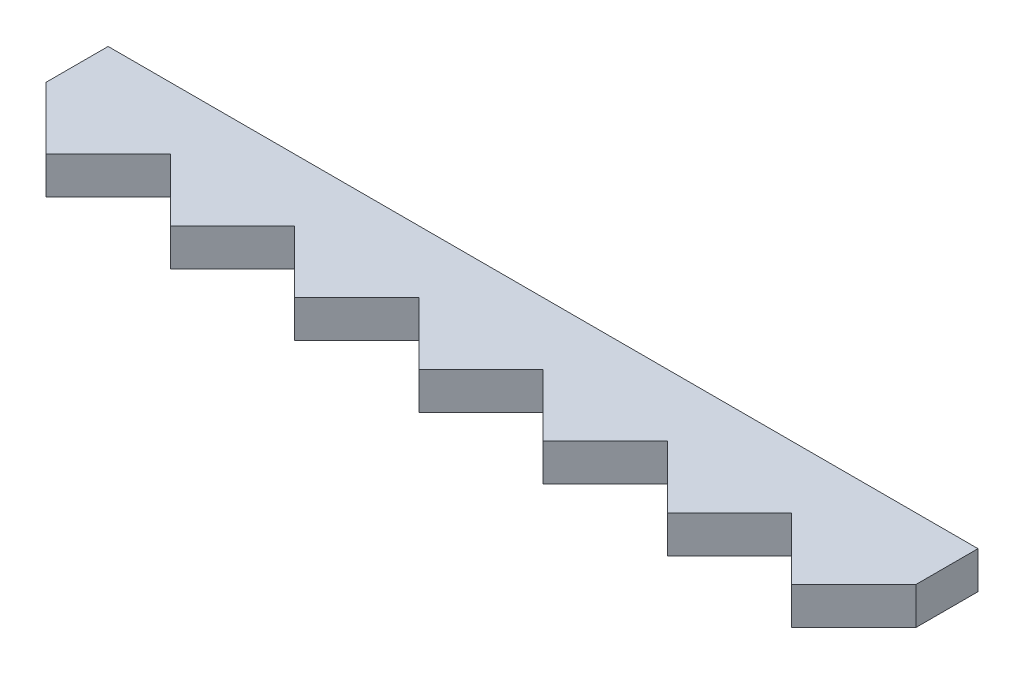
ISO-10303-21;
HEADER;
FILE_DESCRIPTION(('STEP AP214'),'2;1');
FILE_NAME('part.step','',(''),(''),'','','');
FILE_SCHEMA(('AUTOMOTIVE_DESIGN { 1 0 10303 214 1 1 1 1 }'));
ENDSEC;
DATA;
#1=APPLICATION_CONTEXT('core data for automotive mechanical design processes');
#2=APPLICATION_PROTOCOL_DEFINITION('international standard','automotive_design',2000,#1);
#3=PRODUCT_CONTEXT('',#1,'mechanical');
#4=PRODUCT('Part','Part','',(#3));
#5=PRODUCT_RELATED_PRODUCT_CATEGORY('part','',(#4));
#6=PRODUCT_DEFINITION_FORMATION('','',#4);
#7=PRODUCT_DEFINITION_CONTEXT('part definition',#1,'design');
#8=PRODUCT_DEFINITION('design','',#6,#7);
#9=PRODUCT_DEFINITION_SHAPE('','',#8);
#10=(LENGTH_UNIT() NAMED_UNIT(*) SI_UNIT(.MILLI.,.METRE.));
#11=(NAMED_UNIT(*) PLANE_ANGLE_UNIT() SI_UNIT($,.RADIAN.));
#12=(NAMED_UNIT(*) SI_UNIT($,.STERADIAN.) SOLID_ANGLE_UNIT());
#13=UNCERTAINTY_MEASURE_WITH_UNIT(LENGTH_MEASURE(1.E-05),#10,'distance_accuracy_value','');
#14=(GEOMETRIC_REPRESENTATION_CONTEXT(3) GLOBAL_UNCERTAINTY_ASSIGNED_CONTEXT((#13)) GLOBAL_UNIT_ASSIGNED_CONTEXT((#10,
#11,#12)) REPRESENTATION_CONTEXT('',''));
#15=CARTESIAN_POINT('',(0.,0.,0.));
#16=DIRECTION('',(0.,0.,1.));
#17=DIRECTION('',(1.,0.,0.));
#18=AXIS2_PLACEMENT_3D('',#15,#16,#17);
#19=CARTESIAN_POINT('',(0.,6.,-32.1404036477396));
#20=DIRECTION('',(0.,0.,1.));
#21=DIRECTION('',(1.,0.,0.));
#22=AXIS2_PLACEMENT_3D('',#19,#20,#21);
#23=PLANE('',#22);
#24=DIRECTION('',(-1.,0.,0.));
#25=VECTOR('',#24,1.);
#26=CARTESIAN_POINT('',(0.,3.,-32.1404036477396));
#27=LINE('',#26,#25);
#28=CARTESIAN_POINT('',(70.,3.,-32.1404036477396));
#29=VERTEX_POINT('',#28);
#30=CARTESIAN_POINT('',(0.,3.,-32.1404036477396));
#31=VERTEX_POINT('',#30);
#32=EDGE_CURVE('E183',#29,#31,#27,.T.);
#33=ORIENTED_EDGE('',*,*,#32,.T.);
#34=DIRECTION('',(0.,-1.,0.));
#35=VECTOR('',#34,1.);
#36=CARTESIAN_POINT('',(0.,6.,-32.1404036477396));
#37=LINE('',#36,#35);
#38=CARTESIAN_POINT('',(0.,6.,-32.1404036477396));
#39=VERTEX_POINT('',#38);
#40=EDGE_CURVE('E11',#39,#31,#37,.T.);
#41=ORIENTED_EDGE('',*,*,#40,.F.);
#42=DIRECTION('',(-1.,0.,0.));
#43=VECTOR('',#42,1.);
#44=CARTESIAN_POINT('',(0.,6.,-32.1404036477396));
#45=LINE('',#44,#43);
#46=CARTESIAN_POINT('',(70.,6.,-32.1404036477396));
#47=VERTEX_POINT('',#46);
#48=EDGE_CURVE('E215',#47,#39,#45,.T.);
#49=ORIENTED_EDGE('',*,*,#48,.F.);
#50=DIRECTION('',(0.,-1.,0.));
#51=VECTOR('',#50,1.);
#52=CARTESIAN_POINT('',(70.,6.,-32.1404036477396));
#53=LINE('',#52,#51);
#54=EDGE_CURVE('E179',#47,#29,#53,.T.);
#55=ORIENTED_EDGE('',*,*,#54,.T.);
#56=EDGE_LOOP('',(#33,#41,#49,#55));
#57=FACE_BOUND('',#56,.T.);
#58=ADVANCED_FACE('F33',(#57),#23,.F.);
#59=CARTESIAN_POINT('',(0.,6.,-32.1404036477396));
#60=DIRECTION('',(1.,0.,0.));
#61=DIRECTION('',(0.,0.,-1.));
#62=AXIS2_PLACEMENT_3D('',#59,#60,#61);
#63=PLANE('',#62);
#64=DIRECTION('',(0.,0.,1.));
#65=VECTOR('',#64,1.);
#66=CARTESIAN_POINT('',(0.,3.,-32.1404036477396));
#67=LINE('',#66,#65);
#68=CARTESIAN_POINT('',(0.,3.,-27.1404036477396));
#69=VERTEX_POINT('',#68);
#70=EDGE_CURVE('E186',#31,#69,#67,.T.);
#71=ORIENTED_EDGE('',*,*,#70,.T.);
#72=DIRECTION('',(0.,-1.,0.));
#73=VECTOR('',#72,1.);
#74=CARTESIAN_POINT('',(0.,6.,-27.1404036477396));
#75=LINE('',#74,#73);
#76=CARTESIAN_POINT('',(0.,6.,-27.1404036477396));
#77=VERTEX_POINT('',#76);
#78=EDGE_CURVE('E41',#77,#69,#75,.T.);
#79=ORIENTED_EDGE('',*,*,#78,.F.);
#80=DIRECTION('',(0.,0.,1.));
#81=VECTOR('',#80,1.);
#82=CARTESIAN_POINT('',(0.,6.,-32.1404036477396));
#83=LINE('',#82,#81);
#84=EDGE_CURVE('E119',#39,#77,#83,.T.);
#85=ORIENTED_EDGE('',*,*,#84,.F.);
#86=ORIENTED_EDGE('',*,*,#40,.T.);
#87=EDGE_LOOP('',(#71,#79,#85,#86));
#88=FACE_BOUND('',#87,.T.);
#89=ADVANCED_FACE('F318',(#88),#63,.F.);
#90=CARTESIAN_POINT('',(0.,6.,-27.1404036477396));
#91=DIRECTION('',(0.707106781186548,0.,-0.707106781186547));
#92=DIRECTION('',(-0.707106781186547,0.,-0.707106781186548));
#93=AXIS2_PLACEMENT_3D('',#90,#91,#92);
#94=PLANE('',#93);
#95=DIRECTION('',(0.707106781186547,0.,0.707106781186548));
#96=VECTOR('',#95,1.);
#97=CARTESIAN_POINT('',(0.,3.,-27.1404036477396));
#98=LINE('',#97,#96);
#99=CARTESIAN_POINT('',(5.,3.,-22.1404036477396));
#100=VERTEX_POINT('',#99);
#101=EDGE_CURVE('E188',#69,#100,#98,.T.);
#102=ORIENTED_EDGE('',*,*,#101,.T.);
#103=DIRECTION('',(0.,-1.,0.));
#104=VECTOR('',#103,1.);
#105=CARTESIAN_POINT('',(5.,6.,-22.1404036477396));
#106=LINE('',#105,#104);
#107=CARTESIAN_POINT('',(5.,6.,-22.1404036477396));
#108=VERTEX_POINT('',#107);
#109=EDGE_CURVE('E249',#108,#100,#106,.T.);
#110=ORIENTED_EDGE('',*,*,#109,.F.);
#111=DIRECTION('',(0.707106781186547,0.,0.707106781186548));
#112=VECTOR('',#111,1.);
#113=CARTESIAN_POINT('',(0.,6.,-27.1404036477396));
#114=LINE('',#113,#112);
#115=EDGE_CURVE('E257',#77,#108,#114,.T.);
#116=ORIENTED_EDGE('',*,*,#115,.F.);
#117=ORIENTED_EDGE('',*,*,#78,.T.);
#118=EDGE_LOOP('',(#102,#110,#116,#117));
#119=FACE_BOUND('',#118,.T.);
#120=ADVANCED_FACE('F255',(#119),#94,.F.);
#121=CARTESIAN_POINT('',(5.,6.,-22.1404036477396));
#122=DIRECTION('',(-0.707106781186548,0.,-0.707106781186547));
#123=DIRECTION('',(-0.707106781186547,0.,0.707106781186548));
#124=AXIS2_PLACEMENT_3D('',#121,#122,#123);
#125=PLANE('',#124);
#126=DIRECTION('',(0.707106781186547,0.,-0.707106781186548));
#127=VECTOR('',#126,1.);
#128=CARTESIAN_POINT('',(5.,3.,-22.1404036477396));
#129=LINE('',#128,#127);
#130=CARTESIAN_POINT('',(10.,3.,-27.1404036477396));
#131=VERTEX_POINT('',#130);
#132=EDGE_CURVE('E190',#100,#131,#129,.T.);
#133=ORIENTED_EDGE('',*,*,#132,.T.);
#134=DIRECTION('',(0.,-1.,0.));
#135=VECTOR('',#134,1.);
#136=CARTESIAN_POINT('',(10.,6.,-27.1404036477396));
#137=LINE('',#136,#135);
#138=CARTESIAN_POINT('',(10.,6.,-27.1404036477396));
#139=VERTEX_POINT('',#138);
#140=EDGE_CURVE('E246',#139,#131,#137,.T.);
#141=ORIENTED_EDGE('',*,*,#140,.F.);
#142=DIRECTION('',(0.707106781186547,0.,-0.707106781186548));
#143=VECTOR('',#142,1.);
#144=CARTESIAN_POINT('',(5.,6.,-22.1404036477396));
#145=LINE('',#144,#143);
#146=EDGE_CURVE('E275',#108,#139,#145,.T.);
#147=ORIENTED_EDGE('',*,*,#146,.F.);
#148=ORIENTED_EDGE('',*,*,#109,.T.);
#149=EDGE_LOOP('',(#133,#141,#147,#148));
#150=FACE_BOUND('',#149,.T.);
#151=ADVANCED_FACE('F266',(#150),#125,.F.);
#152=CARTESIAN_POINT('',(10.,6.,-27.1404036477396));
#153=DIRECTION('',(0.707106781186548,0.,-0.707106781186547));
#154=DIRECTION('',(-0.707106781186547,0.,-0.707106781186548));
#155=AXIS2_PLACEMENT_3D('',#152,#153,#154);
#156=PLANE('',#155);
#157=DIRECTION('',(0.707106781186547,0.,0.707106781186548));
#158=VECTOR('',#157,1.);
#159=CARTESIAN_POINT('',(10.,3.,-27.1404036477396));
#160=LINE('',#159,#158);
#161=CARTESIAN_POINT('',(15.,3.,-22.1404036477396));
#162=VERTEX_POINT('',#161);
#163=EDGE_CURVE('E192',#131,#162,#160,.T.);
#164=ORIENTED_EDGE('',*,*,#163,.T.);
#165=DIRECTION('',(0.,-1.,0.));
#166=VECTOR('',#165,1.);
#167=CARTESIAN_POINT('',(15.,6.,-22.1404036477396));
#168=LINE('',#167,#166);
#169=CARTESIAN_POINT('',(15.,6.,-22.1404036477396));
#170=VERTEX_POINT('',#169);
#171=EDGE_CURVE('E243',#170,#162,#168,.T.);
#172=ORIENTED_EDGE('',*,*,#171,.F.);
#173=DIRECTION('',(0.707106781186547,0.,0.707106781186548));
#174=VECTOR('',#173,1.);
#175=CARTESIAN_POINT('',(10.,6.,-27.1404036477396));
#176=LINE('',#175,#174);
#177=EDGE_CURVE('E272',#139,#170,#176,.T.);
#178=ORIENTED_EDGE('',*,*,#177,.F.);
#179=ORIENTED_EDGE('',*,*,#140,.T.);
#180=EDGE_LOOP('',(#164,#172,#178,#179));
#181=FACE_BOUND('',#180,.T.);
#182=ADVANCED_FACE('F270',(#181),#156,.F.);
#183=CARTESIAN_POINT('',(15.,6.,-22.1404036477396));
#184=DIRECTION('',(-0.707106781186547,0.,-0.707106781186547));
#185=DIRECTION('',(-0.707106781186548,0.,0.707106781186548));
#186=AXIS2_PLACEMENT_3D('',#183,#184,#185);
#187=PLANE('',#186);
#188=DIRECTION('',(0.707106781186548,0.,-0.707106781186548));
#189=VECTOR('',#188,1.);
#190=CARTESIAN_POINT('',(15.,3.,-22.1404036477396));
#191=LINE('',#190,#189);
#192=CARTESIAN_POINT('',(20.,3.,-27.1404036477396));
#193=VERTEX_POINT('',#192);
#194=EDGE_CURVE('E194',#162,#193,#191,.T.);
#195=ORIENTED_EDGE('',*,*,#194,.T.);
#196=DIRECTION('',(0.,-1.,0.));
#197=VECTOR('',#196,1.);
#198=CARTESIAN_POINT('',(20.,6.,-27.1404036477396));
#199=LINE('',#198,#197);
#200=CARTESIAN_POINT('',(20.,6.,-27.1404036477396));
#201=VERTEX_POINT('',#200);
#202=EDGE_CURVE('E240',#201,#193,#199,.T.);
#203=ORIENTED_EDGE('',*,*,#202,.F.);
#204=DIRECTION('',(0.707106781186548,0.,-0.707106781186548));
#205=VECTOR('',#204,1.);
#206=CARTESIAN_POINT('',(15.,6.,-22.1404036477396));
#207=LINE('',#206,#205);
#208=EDGE_CURVE('E274',#170,#201,#207,.T.);
#209=ORIENTED_EDGE('',*,*,#208,.F.);
#210=ORIENTED_EDGE('',*,*,#171,.T.);
#211=EDGE_LOOP('',(#195,#203,#209,#210));
#212=FACE_BOUND('',#211,.T.);
#213=ADVANCED_FACE('F331',(#212),#187,.F.);
#214=CARTESIAN_POINT('',(20.,6.,-27.1404036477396));
#215=DIRECTION('',(0.707106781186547,0.,-0.707106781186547));
#216=DIRECTION('',(-0.707106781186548,0.,-0.707106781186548));
#217=AXIS2_PLACEMENT_3D('',#214,#215,#216);
#218=PLANE('',#217);
#219=DIRECTION('',(0.707106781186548,0.,0.707106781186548));
#220=VECTOR('',#219,1.);
#221=CARTESIAN_POINT('',(20.,3.,-27.1404036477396));
#222=LINE('',#221,#220);
#223=CARTESIAN_POINT('',(25.,3.,-22.1404036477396));
#224=VERTEX_POINT('',#223);
#225=EDGE_CURVE('E196',#193,#224,#222,.T.);
#226=ORIENTED_EDGE('',*,*,#225,.T.);
#227=DIRECTION('',(0.,-1.,0.));
#228=VECTOR('',#227,1.);
#229=CARTESIAN_POINT('',(25.,6.,-22.1404036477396));
#230=LINE('',#229,#228);
#231=CARTESIAN_POINT('',(25.,6.,-22.1404036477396));
#232=VERTEX_POINT('',#231);
#233=EDGE_CURVE('E237',#232,#224,#230,.T.);
#234=ORIENTED_EDGE('',*,*,#233,.F.);
#235=DIRECTION('',(0.707106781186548,0.,0.707106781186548));
#236=VECTOR('',#235,1.);
#237=CARTESIAN_POINT('',(20.,6.,-27.1404036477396));
#238=LINE('',#237,#236);
#239=EDGE_CURVE('E277',#201,#232,#238,.T.);
#240=ORIENTED_EDGE('',*,*,#239,.F.);
#241=ORIENTED_EDGE('',*,*,#202,.T.);
#242=EDGE_LOOP('',(#226,#234,#240,#241));
#243=FACE_BOUND('',#242,.T.);
#244=ADVANCED_FACE('F334',(#243),#218,.F.);
#245=CARTESIAN_POINT('',(25.,6.,-22.1404036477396));
#246=DIRECTION('',(-0.707106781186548,0.,-0.707106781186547));
#247=DIRECTION('',(-0.707106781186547,0.,0.707106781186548));
#248=AXIS2_PLACEMENT_3D('',#245,#246,#247);
#249=PLANE('',#248);
#250=DIRECTION('',(0.707106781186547,0.,-0.707106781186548));
#251=VECTOR('',#250,1.);
#252=CARTESIAN_POINT('',(25.,3.,-22.1404036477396));
#253=LINE('',#252,#251);
#254=CARTESIAN_POINT('',(30.,3.,-27.1404036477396));
#255=VERTEX_POINT('',#254);
#256=EDGE_CURVE('E198',#224,#255,#253,.T.);
#257=ORIENTED_EDGE('',*,*,#256,.T.);
#258=DIRECTION('',(0.,-1.,0.));
#259=VECTOR('',#258,1.);
#260=CARTESIAN_POINT('',(30.,6.,-27.1404036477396));
#261=LINE('',#260,#259);
#262=CARTESIAN_POINT('',(30.,6.,-27.1404036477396));
#263=VERTEX_POINT('',#262);
#264=EDGE_CURVE('E234',#263,#255,#261,.T.);
#265=ORIENTED_EDGE('',*,*,#264,.F.);
#266=DIRECTION('',(0.707106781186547,0.,-0.707106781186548));
#267=VECTOR('',#266,1.);
#268=CARTESIAN_POINT('',(25.,6.,-22.1404036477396));
#269=LINE('',#268,#267);
#270=EDGE_CURVE('E283',#232,#263,#269,.T.);
#271=ORIENTED_EDGE('',*,*,#270,.F.);
#272=ORIENTED_EDGE('',*,*,#233,.T.);
#273=EDGE_LOOP('',(#257,#265,#271,#272));
#274=FACE_BOUND('',#273,.T.);
#275=ADVANCED_FACE('F338',(#274),#249,.F.);
#276=CARTESIAN_POINT('',(30.,6.,-27.1404036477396));
#277=DIRECTION('',(0.707106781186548,0.,-0.707106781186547));
#278=DIRECTION('',(-0.707106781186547,0.,-0.707106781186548));
#279=AXIS2_PLACEMENT_3D('',#276,#277,#278);
#280=PLANE('',#279);
#281=DIRECTION('',(0.707106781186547,0.,0.707106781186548));
#282=VECTOR('',#281,1.);
#283=CARTESIAN_POINT('',(30.,3.,-27.1404036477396));
#284=LINE('',#283,#282);
#285=CARTESIAN_POINT('',(35.,3.,-22.1404036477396));
#286=VERTEX_POINT('',#285);
#287=EDGE_CURVE('E200',#255,#286,#284,.T.);
#288=ORIENTED_EDGE('',*,*,#287,.T.);
#289=DIRECTION('',(0.,-1.,0.));
#290=VECTOR('',#289,1.);
#291=CARTESIAN_POINT('',(35.,6.,-22.1404036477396));
#292=LINE('',#291,#290);
#293=CARTESIAN_POINT('',(35.,6.,-22.1404036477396));
#294=VERTEX_POINT('',#293);
#295=EDGE_CURVE('E231',#294,#286,#292,.T.);
#296=ORIENTED_EDGE('',*,*,#295,.F.);
#297=DIRECTION('',(0.707106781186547,0.,0.707106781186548));
#298=VECTOR('',#297,1.);
#299=CARTESIAN_POINT('',(30.,6.,-27.1404036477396));
#300=LINE('',#299,#298);
#301=EDGE_CURVE('E285',#263,#294,#300,.T.);
#302=ORIENTED_EDGE('',*,*,#301,.F.);
#303=ORIENTED_EDGE('',*,*,#264,.T.);
#304=EDGE_LOOP('',(#288,#296,#302,#303));
#305=FACE_BOUND('',#304,.T.);
#306=ADVANCED_FACE('F342',(#305),#280,.F.);
#307=CARTESIAN_POINT('',(35.,6.,-22.1404036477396));
#308=DIRECTION('',(-0.707106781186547,0.,-0.707106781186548));
#309=DIRECTION('',(-0.707106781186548,0.,0.707106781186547));
#310=AXIS2_PLACEMENT_3D('',#307,#308,#309);
#311=PLANE('',#310);
#312=DIRECTION('',(0.707106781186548,0.,-0.707106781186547));
#313=VECTOR('',#312,1.);
#314=CARTESIAN_POINT('',(35.,3.,-22.1404036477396));
#315=LINE('',#314,#313);
#316=CARTESIAN_POINT('',(40.,3.,-27.1404036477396));
#317=VERTEX_POINT('',#316);
#318=EDGE_CURVE('E202',#286,#317,#315,.T.);
#319=ORIENTED_EDGE('',*,*,#318,.T.);
#320=DIRECTION('',(0.,-1.,0.));
#321=VECTOR('',#320,1.);
#322=CARTESIAN_POINT('',(40.,6.,-27.1404036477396));
#323=LINE('',#322,#321);
#324=CARTESIAN_POINT('',(40.,6.,-27.1404036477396));
#325=VERTEX_POINT('',#324);
#326=EDGE_CURVE('E228',#325,#317,#323,.T.);
#327=ORIENTED_EDGE('',*,*,#326,.F.);
#328=DIRECTION('',(0.707106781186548,0.,-0.707106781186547));
#329=VECTOR('',#328,1.);
#330=CARTESIAN_POINT('',(35.,6.,-22.1404036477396));
#331=LINE('',#330,#329);
#332=EDGE_CURVE('E287',#294,#325,#331,.T.);
#333=ORIENTED_EDGE('',*,*,#332,.F.);
#334=ORIENTED_EDGE('',*,*,#295,.T.);
#335=EDGE_LOOP('',(#319,#327,#333,#334));
#336=FACE_BOUND('',#335,.T.);
#337=ADVANCED_FACE('F346',(#336),#311,.F.);
#338=CARTESIAN_POINT('',(40.,6.,-27.1404036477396));
#339=DIRECTION('',(0.707106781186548,0.,-0.707106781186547));
#340=DIRECTION('',(-0.707106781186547,0.,-0.707106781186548));
#341=AXIS2_PLACEMENT_3D('',#338,#339,#340);
#342=PLANE('',#341);
#343=DIRECTION('',(0.707106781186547,0.,0.707106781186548));
#344=VECTOR('',#343,1.);
#345=CARTESIAN_POINT('',(40.,3.,-27.1404036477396));
#346=LINE('',#345,#344);
#347=CARTESIAN_POINT('',(45.,3.,-22.1404036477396));
#348=VERTEX_POINT('',#347);
#349=EDGE_CURVE('E204',#317,#348,#346,.T.);
#350=ORIENTED_EDGE('',*,*,#349,.T.);
#351=DIRECTION('',(0.,-1.,0.));
#352=VECTOR('',#351,1.);
#353=CARTESIAN_POINT('',(45.,6.,-22.1404036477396));
#354=LINE('',#353,#352);
#355=CARTESIAN_POINT('',(45.,6.,-22.1404036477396));
#356=VERTEX_POINT('',#355);
#357=EDGE_CURVE('E225',#356,#348,#354,.T.);
#358=ORIENTED_EDGE('',*,*,#357,.F.);
#359=DIRECTION('',(0.707106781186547,0.,0.707106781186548));
#360=VECTOR('',#359,1.);
#361=CARTESIAN_POINT('',(40.,6.,-27.1404036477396));
#362=LINE('',#361,#360);
#363=EDGE_CURVE('E289',#325,#356,#362,.T.);
#364=ORIENTED_EDGE('',*,*,#363,.F.);
#365=ORIENTED_EDGE('',*,*,#326,.T.);
#366=EDGE_LOOP('',(#350,#358,#364,#365));
#367=FACE_BOUND('',#366,.T.);
#368=ADVANCED_FACE('F350',(#367),#342,.F.);
#369=CARTESIAN_POINT('',(45.,6.,-22.1404036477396));
#370=DIRECTION('',(-0.707106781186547,0.,-0.707106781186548));
#371=DIRECTION('',(-0.707106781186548,0.,0.707106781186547));
#372=AXIS2_PLACEMENT_3D('',#369,#370,#371);
#373=PLANE('',#372);
#374=DIRECTION('',(0.707106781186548,0.,-0.707106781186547));
#375=VECTOR('',#374,1.);
#376=CARTESIAN_POINT('',(45.,3.,-22.1404036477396));
#377=LINE('',#376,#375);
#378=CARTESIAN_POINT('',(50.,3.,-27.1404036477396));
#379=VERTEX_POINT('',#378);
#380=EDGE_CURVE('E206',#348,#379,#377,.T.);
#381=ORIENTED_EDGE('',*,*,#380,.T.);
#382=DIRECTION('',(0.,-1.,0.));
#383=VECTOR('',#382,1.);
#384=CARTESIAN_POINT('',(50.,6.,-27.1404036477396));
#385=LINE('',#384,#383);
#386=CARTESIAN_POINT('',(50.,6.,-27.1404036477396));
#387=VERTEX_POINT('',#386);
#388=EDGE_CURVE('E222',#387,#379,#385,.T.);
#389=ORIENTED_EDGE('',*,*,#388,.F.);
#390=DIRECTION('',(0.707106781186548,0.,-0.707106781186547));
#391=VECTOR('',#390,1.);
#392=CARTESIAN_POINT('',(45.,6.,-22.1404036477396));
#393=LINE('',#392,#391);
#394=EDGE_CURVE('E291',#356,#387,#393,.T.);
#395=ORIENTED_EDGE('',*,*,#394,.F.);
#396=ORIENTED_EDGE('',*,*,#357,.T.);
#397=EDGE_LOOP('',(#381,#389,#395,#396));
#398=FACE_BOUND('',#397,.T.);
#399=ADVANCED_FACE('F354',(#398),#373,.F.);
#400=CARTESIAN_POINT('',(50.,6.,-27.1404036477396));
#401=DIRECTION('',(0.707106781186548,0.,-0.707106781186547));
#402=DIRECTION('',(-0.707106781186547,0.,-0.707106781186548));
#403=AXIS2_PLACEMENT_3D('',#400,#401,#402);
#404=PLANE('',#403);
#405=DIRECTION('',(0.707106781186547,0.,0.707106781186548));
#406=VECTOR('',#405,1.);
#407=CARTESIAN_POINT('',(50.,3.,-27.1404036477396));
#408=LINE('',#407,#406);
#409=CARTESIAN_POINT('',(55.,3.,-22.1404036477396));
#410=VERTEX_POINT('',#409);
#411=EDGE_CURVE('E208',#379,#410,#408,.T.);
#412=ORIENTED_EDGE('',*,*,#411,.T.);
#413=DIRECTION('',(0.,-1.,0.));
#414=VECTOR('',#413,1.);
#415=CARTESIAN_POINT('',(55.,6.,-22.1404036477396));
#416=LINE('',#415,#414);
#417=CARTESIAN_POINT('',(55.,6.,-22.1404036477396));
#418=VERTEX_POINT('',#417);
#419=EDGE_CURVE('E219',#418,#410,#416,.T.);
#420=ORIENTED_EDGE('',*,*,#419,.F.);
#421=DIRECTION('',(0.707106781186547,0.,0.707106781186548));
#422=VECTOR('',#421,1.);
#423=CARTESIAN_POINT('',(50.,6.,-27.1404036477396));
#424=LINE('',#423,#422);
#425=EDGE_CURVE('E293',#387,#418,#424,.T.);
#426=ORIENTED_EDGE('',*,*,#425,.F.);
#427=ORIENTED_EDGE('',*,*,#388,.T.);
#428=EDGE_LOOP('',(#412,#420,#426,#427));
#429=FACE_BOUND('',#428,.T.);
#430=ADVANCED_FACE('F299',(#429),#404,.F.);
#431=CARTESIAN_POINT('',(55.,6.,-22.1404036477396));
#432=DIRECTION('',(-0.707106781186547,0.,-0.707106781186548));
#433=DIRECTION('',(-0.707106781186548,0.,0.707106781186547));
#434=AXIS2_PLACEMENT_3D('',#431,#432,#433);
#435=PLANE('',#434);
#436=DIRECTION('',(0.707106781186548,0.,-0.707106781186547));
#437=VECTOR('',#436,1.);
#438=CARTESIAN_POINT('',(55.,3.,-22.1404036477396));
#439=LINE('',#438,#437);
#440=CARTESIAN_POINT('',(60.,3.,-27.1404036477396));
#441=VERTEX_POINT('',#440);
#442=EDGE_CURVE('E210',#410,#441,#439,.T.);
#443=ORIENTED_EDGE('',*,*,#442,.T.);
#444=DIRECTION('',(0.,-1.,0.));
#445=VECTOR('',#444,1.);
#446=CARTESIAN_POINT('',(60.,6.,-27.1404036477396));
#447=LINE('',#446,#445);
#448=CARTESIAN_POINT('',(60.,6.,-27.1404036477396));
#449=VERTEX_POINT('',#448);
#450=EDGE_CURVE('E174',#449,#441,#447,.T.);
#451=ORIENTED_EDGE('',*,*,#450,.F.);
#452=DIRECTION('',(0.707106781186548,0.,-0.707106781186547));
#453=VECTOR('',#452,1.);
#454=CARTESIAN_POINT('',(55.,6.,-22.1404036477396));
#455=LINE('',#454,#453);
#456=EDGE_CURVE('E165',#418,#449,#455,.T.);
#457=ORIENTED_EDGE('',*,*,#456,.F.);
#458=ORIENTED_EDGE('',*,*,#419,.T.);
#459=EDGE_LOOP('',(#443,#451,#457,#458));
#460=FACE_BOUND('',#459,.T.);
#461=ADVANCED_FACE('F303',(#460),#435,.F.);
#462=CARTESIAN_POINT('',(60.,6.,-27.1404036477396));
#463=DIRECTION('',(0.707106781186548,0.,-0.707106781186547));
#464=DIRECTION('',(-0.707106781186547,0.,-0.707106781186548));
#465=AXIS2_PLACEMENT_3D('',#462,#463,#464);
#466=PLANE('',#465);
#467=DIRECTION('',(0.707106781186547,0.,0.707106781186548));
#468=VECTOR('',#467,1.);
#469=CARTESIAN_POINT('',(60.,3.,-27.1404036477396));
#470=LINE('',#469,#468);
#471=CARTESIAN_POINT('',(65.,3.,-22.1404036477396));
#472=VERTEX_POINT('',#471);
#473=EDGE_CURVE('E173',#441,#472,#470,.T.);
#474=ORIENTED_EDGE('',*,*,#473,.T.);
#475=DIRECTION('',(0.,-1.,0.));
#476=VECTOR('',#475,1.);
#477=CARTESIAN_POINT('',(65.,6.,-22.1404036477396));
#478=LINE('',#477,#476);
#479=CARTESIAN_POINT('',(65.,6.,-22.1404036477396));
#480=VERTEX_POINT('',#479);
#481=EDGE_CURVE('E170',#480,#472,#478,.T.);
#482=ORIENTED_EDGE('',*,*,#481,.F.);
#483=DIRECTION('',(0.707106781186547,0.,0.707106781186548));
#484=VECTOR('',#483,1.);
#485=CARTESIAN_POINT('',(60.,6.,-27.1404036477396));
#486=LINE('',#485,#484);
#487=EDGE_CURVE('E159',#449,#480,#486,.T.);
#488=ORIENTED_EDGE('',*,*,#487,.F.);
#489=ORIENTED_EDGE('',*,*,#450,.T.);
#490=EDGE_LOOP('',(#474,#482,#488,#489));
#491=FACE_BOUND('',#490,.T.);
#492=ADVANCED_FACE('F171',(#491),#466,.F.);
#493=CARTESIAN_POINT('',(65.,6.,-22.1404036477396));
#494=DIRECTION('',(-0.707106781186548,0.,-0.707106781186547));
#495=DIRECTION('',(-0.707106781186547,0.,0.707106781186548));
#496=AXIS2_PLACEMENT_3D('',#493,#494,#495);
#497=PLANE('',#496);
#498=DIRECTION('',(0.707106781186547,0.,-0.707106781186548));
#499=VECTOR('',#498,1.);
#500=CARTESIAN_POINT('',(65.,3.,-22.1404036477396));
#501=LINE('',#500,#499);
#502=CARTESIAN_POINT('',(70.,3.,-27.1404036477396));
#503=VERTEX_POINT('',#502);
#504=EDGE_CURVE('E105',#472,#503,#501,.T.);
#505=ORIENTED_EDGE('',*,*,#504,.T.);
#506=DIRECTION('',(0.,-1.,0.));
#507=VECTOR('',#506,1.);
#508=CARTESIAN_POINT('',(70.,6.,-27.1404036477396));
#509=LINE('',#508,#507);
#510=CARTESIAN_POINT('',(70.,6.,-27.1404036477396));
#511=VERTEX_POINT('',#510);
#512=EDGE_CURVE('E175',#511,#503,#509,.T.);
#513=ORIENTED_EDGE('',*,*,#512,.F.);
#514=DIRECTION('',(0.707106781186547,0.,-0.707106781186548));
#515=VECTOR('',#514,1.);
#516=CARTESIAN_POINT('',(65.,6.,-22.1404036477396));
#517=LINE('',#516,#515);
#518=EDGE_CURVE('E163',#480,#511,#517,.T.);
#519=ORIENTED_EDGE('',*,*,#518,.F.);
#520=ORIENTED_EDGE('',*,*,#481,.T.);
#521=EDGE_LOOP('',(#505,#513,#519,#520));
#522=FACE_BOUND('',#521,.T.);
#523=ADVANCED_FACE('F177',(#522),#497,.F.);
#524=CARTESIAN_POINT('',(70.,6.,-32.1404036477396));
#525=DIRECTION('',(-1.,0.,0.));
#526=DIRECTION('',(0.,0.,1.));
#527=AXIS2_PLACEMENT_3D('',#524,#525,#526);
#528=PLANE('',#527);
#529=DIRECTION('',(0.,0.,-1.));
#530=VECTOR('',#529,1.);
#531=CARTESIAN_POINT('',(70.,3.,-32.1404036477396));
#532=LINE('',#531,#530);
#533=EDGE_CURVE('E111',#503,#29,#532,.T.);
#534=ORIENTED_EDGE('',*,*,#533,.T.);
#535=ORIENTED_EDGE('',*,*,#54,.F.);
#536=DIRECTION('',(0.,0.,-1.));
#537=VECTOR('',#536,1.);
#538=CARTESIAN_POINT('',(70.,6.,-32.1404036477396));
#539=LINE('',#538,#537);
#540=EDGE_CURVE('E49',#511,#47,#539,.T.);
#541=ORIENTED_EDGE('',*,*,#540,.F.);
#542=ORIENTED_EDGE('',*,*,#512,.T.);
#543=EDGE_LOOP('',(#534,#535,#541,#542));
#544=FACE_BOUND('',#543,.T.);
#545=ADVANCED_FACE('F307',(#544),#528,.F.);
#546=CARTESIAN_POINT('',(0.,6.,0.));
#547=DIRECTION('',(0.,-1.,0.));
#548=DIRECTION('',(0.,0.,-1.));
#549=AXIS2_PLACEMENT_3D('',#546,#547,#548);
#550=PLANE('',#549);
#551=ORIENTED_EDGE('',*,*,#48,.T.);
#552=ORIENTED_EDGE('',*,*,#84,.T.);
#553=ORIENTED_EDGE('',*,*,#115,.T.);
#554=ORIENTED_EDGE('',*,*,#146,.T.);
#555=ORIENTED_EDGE('',*,*,#177,.T.);
#556=ORIENTED_EDGE('',*,*,#208,.T.);
#557=ORIENTED_EDGE('',*,*,#239,.T.);
#558=ORIENTED_EDGE('',*,*,#270,.T.);
#559=ORIENTED_EDGE('',*,*,#301,.T.);
#560=ORIENTED_EDGE('',*,*,#332,.T.);
#561=ORIENTED_EDGE('',*,*,#363,.T.);
#562=ORIENTED_EDGE('',*,*,#394,.T.);
#563=ORIENTED_EDGE('',*,*,#425,.T.);
#564=ORIENTED_EDGE('',*,*,#456,.T.);
#565=ORIENTED_EDGE('',*,*,#487,.T.);
#566=ORIENTED_EDGE('',*,*,#518,.T.);
#567=ORIENTED_EDGE('',*,*,#540,.T.);
#568=EDGE_LOOP('',(#551,#552,#553,#554,#555,#556,#557,#558,#559,#560,#561,#562,#563,#564,#565,
#566,#567));
#569=FACE_BOUND('',#568,.T.);
#570=ADVANCED_FACE('F161',(#569),#550,.F.);
#571=CARTESIAN_POINT('',(0.,3.,0.));
#572=DIRECTION('',(0.,-1.,0.));
#573=DIRECTION('',(0.,0.,-1.));
#574=AXIS2_PLACEMENT_3D('',#571,#572,#573);
#575=PLANE('',#574);
#576=ORIENTED_EDGE('',*,*,#32,.F.);
#577=ORIENTED_EDGE('',*,*,#533,.F.);
#578=ORIENTED_EDGE('',*,*,#504,.F.);
#579=ORIENTED_EDGE('',*,*,#473,.F.);
#580=ORIENTED_EDGE('',*,*,#442,.F.);
#581=ORIENTED_EDGE('',*,*,#411,.F.);
#582=ORIENTED_EDGE('',*,*,#380,.F.);
#583=ORIENTED_EDGE('',*,*,#349,.F.);
#584=ORIENTED_EDGE('',*,*,#318,.F.);
#585=ORIENTED_EDGE('',*,*,#287,.F.);
#586=ORIENTED_EDGE('',*,*,#256,.F.);
#587=ORIENTED_EDGE('',*,*,#225,.F.);
#588=ORIENTED_EDGE('',*,*,#194,.F.);
#589=ORIENTED_EDGE('',*,*,#163,.F.);
#590=ORIENTED_EDGE('',*,*,#132,.F.);
#591=ORIENTED_EDGE('',*,*,#101,.F.);
#592=ORIENTED_EDGE('',*,*,#70,.F.);
#593=EDGE_LOOP('',(#576,#577,#578,#579,#580,#581,#582,#583,#584,#585,#586,#587,#588,#589,#590,
#591,#592));
#594=FACE_BOUND('',#593,.T.);
#595=ADVANCED_FACE('F261',(#594),#575,.T.);
#596=CLOSED_SHELL('',(#58,#89,#120,#151,#182,#213,#244,#275,#306,#337,#368,#399,#430,#461,#492,
#523,#545,#570,#595));
#597=MANIFOLD_SOLID_BREP('B2',#596);
#598=ADVANCED_BREP_SHAPE_REPRESENTATION('',(#18,#597),#14);
#599=SHAPE_DEFINITION_REPRESENTATION(#9,#598);
ENDSEC;
END-ISO-10303-21;
